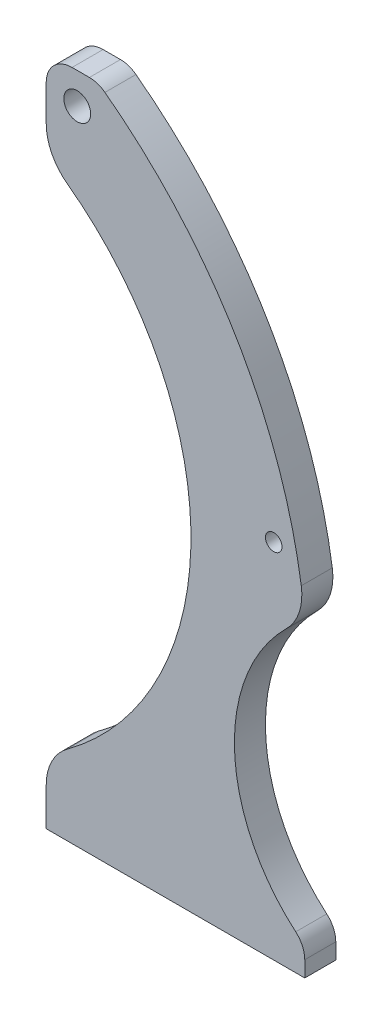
from build123d import *

# Parameters (mm, degrees)
ESQUISSE1_W             = 50
ESQUISSE1_H             = 130
EXTRUSION1_DEPTH        = 6
ESQUISSE3_R             = 2.6
ESQUISSE3_R_2           = 1.6
ENL_V_MAT_EXTRU_1_DEPTH = 6
ENL_V_MAT_EXTRU_2_DEPTH = 20
CONG_1_R                = 10
CONG_2_R                = 5


with BuildPart() as part:
    # Esquisse1 → Extrusion1 (new body)
    with BuildSketch(Plane.XY):
        with Locations((-2.937764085, -11.025)):
            Rectangle(ESQUISSE1_W, ESQUISSE1_H)
    extrude(amount=EXTRUSION1_DEPTH)

    # Esquisse3 → Enl_v. mat.-Extru.1 (cut)
    with BuildSketch(Plane.XY.offset(6)):
        with Locations((-21.937764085, 47.975)):
            Circle(ESQUISSE3_R)
        with Locations((16.062235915, -6.025)):
            Circle(ESQUISSE3_R_2)
        Polygon((-7.937764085, 53.975), (22.062235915, 3.975), (22.062235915, 53.975), align=None)
    extrude(amount=-ENL_V_MAT_EXTRU_1_DEPTH, mode=Mode.SUBTRACT)

    # Esquisse4 → Enl_v. mat.-Extru.2 (cut)
    with BuildSketch(Plane.XY.offset(6)):
        with BuildLine():
            Line((-27.937764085, 36.785641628), (-27.937764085, -63.408020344))
            ThreePointArc((-27.937764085, -63.408020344), (0.051382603, -13.311189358), (-27.937764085, 36.785641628))
        make_face()
        with BuildLine():
            Line((-17.937764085, 53.975), (9.122584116, 53.975))
            Line((9.122584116, 53.975), (35.098718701, 7.628755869))
            Line((35.098718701, 7.628755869), (22.062235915, -70.564710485))
            ThreePointArc((22.062235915, -70.564710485), (8.455247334, -43.39579421), (22.062235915, -16.226877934))
            ThreePointArc((22.062235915, -16.226877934), (9.650339, 23.197650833), (-17.937764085, 53.975))
        make_face()
    extrude(amount=-ENL_V_MAT_EXTRU_2_DEPTH, mode=Mode.SUBTRACT)

    # Cong_1
    cong_1_edges = [part.edges().sort_by_distance(p)[0] for p in [
        (-27.937764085, 36.785641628, 3),
        (-27.937764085, -63.408020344, 3),
        (22.062235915, -16.226877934, 3),
    ]]
    fillet(cong_1_edges, radius=CONG_1_R)

    # Cong_2
    cong_2_edges = [part.edges().sort_by_distance(p)[0] for p in [
        (22.062235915, -70.564710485, 3),
        (-17.937764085, 53.975, 3),
        (-27.937764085, 53.975, 3),
    ]]
    fillet(cong_2_edges, radius=CONG_2_R)


solid = part.part
